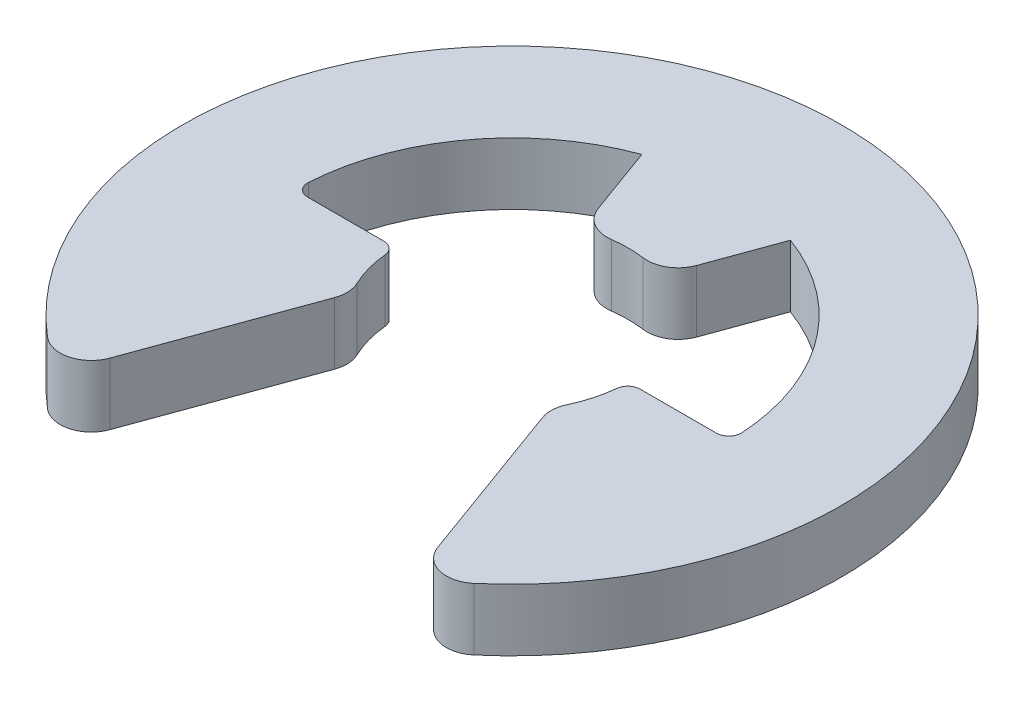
from build123d import *

# Parameters (mm, degrees)
BOSS_EXTRUDE1_DEPTH = 0.2
FILLET1_R           = 0.2
FILLET2_R           = 0.08


with BuildPart() as part:
    # Sketch2 → Boss-Extrude1 (new, symmetric)
    with BuildSketch(Plane(origin=(0, 0, 0), x_dir=(1, 0, 0), z_dir=(0, 1, 0))):
        with BuildLine():
            Line((-1.148434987, -1.787937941), (-0.64, -0.391024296))
            ThreePointArc((-0.64, -0.391024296), (-0.721976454, -0.20310096), (-0.75, 0))
            Line((-0.75, 0), (-1.4, 0))
            ThreePointArc((-1.4, 0), (-1.146812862, 0.803007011), (-0.478828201, 1.315569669))
            Line((-0.478828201, 1.315569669), (-0.256515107, 0.704769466))
            ThreePointArc((-0.256515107, 0.704769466), (0, 0.75), (0.256515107, 0.704769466))
            Line((0.256515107, 0.704769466), (0.478828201, 1.315569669))
            ThreePointArc((0.478828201, 1.315569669), (1.146812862, 0.803007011), (1.4, 0))
            Line((1.4, 0), (0.75, 0))
            ThreePointArc((0.75, 0), (0.721976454, -0.20310096), (0.64, -0.391024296))
            Line((0.64, -0.391024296), (1.148434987, -1.787937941))
            ThreePointArc((1.148434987, -1.787937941), (0, 2.125), (-1.148434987, -1.787937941))
        make_face()
    extrude(amount=BOSS_EXTRUDE1_DEPTH, both=True)

    # Fillet1
    fillet1_edges = [part.edges().sort_by_distance(p)[0] for p in [
        (-0.64, 0, 0.391024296),
        (-1.148434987, 0, 1.787937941),
        (1.148434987, 0, 1.787937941),
        (0.64, 0, 0.391024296),
        (0.256515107, 0, -0.704769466),
        (-0.256515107, 0, -0.704769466),
    ]]
    fillet(fillet1_edges, radius=FILLET1_R)

    # Fillet2
    fillet2_edges = [part.edges().sort_by_distance(p)[0] for p in [
        (-1.4, 0, 0),
        (-0.75, 0, 0),
        (0.75, 0, 0),
        (1.4, 0, 0),
    ]]
    fillet(fillet2_edges, radius=FILLET2_R)


solid = part.part
